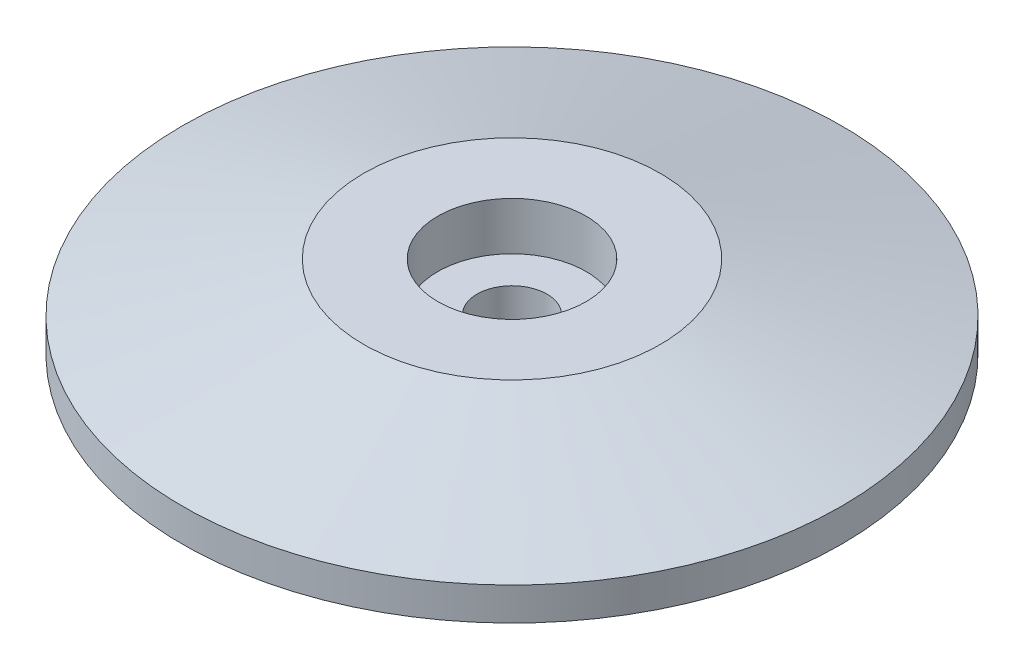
ISO-10303-21;
HEADER;
FILE_DESCRIPTION(('STEP AP214'),'2;1');
FILE_NAME('part.step','',(''),(''),'','','');
FILE_SCHEMA(('AUTOMOTIVE_DESIGN { 1 0 10303 214 1 1 1 1 }'));
ENDSEC;
DATA;
#1=APPLICATION_CONTEXT('core data for automotive mechanical design processes');
#2=APPLICATION_PROTOCOL_DEFINITION('international standard','automotive_design',2000,#1);
#3=PRODUCT_CONTEXT('',#1,'mechanical');
#4=PRODUCT('Part','Part','',(#3));
#5=PRODUCT_RELATED_PRODUCT_CATEGORY('part','',(#4));
#6=PRODUCT_DEFINITION_FORMATION('','',#4);
#7=PRODUCT_DEFINITION_CONTEXT('part definition',#1,'design');
#8=PRODUCT_DEFINITION('design','',#6,#7);
#9=PRODUCT_DEFINITION_SHAPE('','',#8);
#10=(LENGTH_UNIT() NAMED_UNIT(*) SI_UNIT(.MILLI.,.METRE.));
#11=(NAMED_UNIT(*) PLANE_ANGLE_UNIT() SI_UNIT($,.RADIAN.));
#12=(NAMED_UNIT(*) SI_UNIT($,.STERADIAN.) SOLID_ANGLE_UNIT());
#13=UNCERTAINTY_MEASURE_WITH_UNIT(LENGTH_MEASURE(1.E-05),#10,'distance_accuracy_value','');
#14=(GEOMETRIC_REPRESENTATION_CONTEXT(3) GLOBAL_UNCERTAINTY_ASSIGNED_CONTEXT((#13)) GLOBAL_UNIT_ASSIGNED_CONTEXT((#10,
#11,#12)) REPRESENTATION_CONTEXT('',''));
#15=CARTESIAN_POINT('',(0.,0.,0.));
#16=DIRECTION('',(0.,0.,1.));
#17=DIRECTION('',(1.,0.,0.));
#18=AXIS2_PLACEMENT_3D('',#15,#16,#17);
#19=CARTESIAN_POINT('',(28.575,15.875,0.));
#20=DIRECTION('',(0.,-1.,0.));
#21=DIRECTION('',(1.,0.,0.));
#22=AXIS2_PLACEMENT_3D('',#19,#20,#21);
#23=PLANE('',#22);
#24=CARTESIAN_POINT('',(0.,15.875,0.));
#25=DIRECTION('',(0.,1.,0.));
#26=DIRECTION('',(0.,0.,1.));
#27=AXIS2_PLACEMENT_3D('',#24,#25,#26);
#28=CIRCLE('',#27,14.2875);
#29=CARTESIAN_POINT('',(0.,15.875,14.2875));
#30=VERTEX_POINT('',#29);
#31=EDGE_CURVE('E80',#30,#30,#28,.T.);
#32=ORIENTED_EDGE('',*,*,#31,.F.);
#33=EDGE_LOOP('',(#32));
#34=FACE_BOUND('',#33,.T.);
#35=CARTESIAN_POINT('',(0.,15.875,0.));
#36=DIRECTION('',(0.,1.,0.));
#37=DIRECTION('',(-1.,0.,0.));
#38=AXIS2_PLACEMENT_3D('',#35,#36,#37);
#39=CIRCLE('',#38,28.575);
#40=CARTESIAN_POINT('',(-28.575,15.875,0.));
#41=VERTEX_POINT('',#40);
#42=EDGE_CURVE('E10',#41,#41,#39,.T.);
#43=ORIENTED_EDGE('',*,*,#42,.T.);
#44=EDGE_LOOP('',(#43));
#45=FACE_BOUND('',#44,.T.);
#46=ADVANCED_FACE('F37',(#34,#45),#23,.F.);
#47=CARTESIAN_POINT('',(0.,6.35000000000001,0.));
#48=DIRECTION('',(0.,-1.,0.));
#49=DIRECTION('',(1.,0.,0.));
#50=AXIS2_PLACEMENT_3D('',#47,#48,#49);
#51=CONICAL_SURFACE('',#50,63.5,1.30454427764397);
#52=ORIENTED_EDGE('',*,*,#42,.F.);
#53=EDGE_LOOP('',(#52));
#54=FACE_BOUND('',#53,.T.);
#55=CARTESIAN_POINT('',(0.,6.35000000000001,0.));
#56=DIRECTION('',(0.,1.,0.));
#57=DIRECTION('',(-1.,0.,0.));
#58=AXIS2_PLACEMENT_3D('',#55,#56,#57);
#59=CIRCLE('',#58,63.5);
#60=CARTESIAN_POINT('',(-63.5,6.35000000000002,0.));
#61=VERTEX_POINT('',#60);
#62=EDGE_CURVE('E50',#61,#61,#59,.T.);
#63=ORIENTED_EDGE('',*,*,#62,.T.);
#64=EDGE_LOOP('',(#63));
#65=FACE_BOUND('',#64,.T.);
#66=ADVANCED_FACE('F120',(#54,#65),#51,.T.);
#67=CARTESIAN_POINT('',(0.,15.875,0.));
#68=DIRECTION('',(0.,1.,0.));
#69=DIRECTION('',(-1.,0.,0.));
#70=AXIS2_PLACEMENT_3D('',#67,#68,#69);
#71=CYLINDRICAL_SURFACE('',#70,63.5);
#72=ORIENTED_EDGE('',*,*,#62,.F.);
#73=EDGE_LOOP('',(#72));
#74=FACE_BOUND('',#73,.T.);
#75=CARTESIAN_POINT('',(0.,0.,0.));
#76=DIRECTION('',(0.,1.,0.));
#77=DIRECTION('',(-1.,0.,0.));
#78=AXIS2_PLACEMENT_3D('',#75,#76,#77);
#79=CIRCLE('',#78,63.5);
#80=CARTESIAN_POINT('',(-63.5,0.,0.));
#81=VERTEX_POINT('',#80);
#82=EDGE_CURVE('E52',#81,#81,#79,.T.);
#83=ORIENTED_EDGE('',*,*,#82,.T.);
#84=EDGE_LOOP('',(#83));
#85=FACE_BOUND('',#84,.T.);
#86=ADVANCED_FACE('F122',(#74,#85),#71,.T.);
#87=CARTESIAN_POINT('',(0.,0.,0.));
#88=DIRECTION('',(0.,1.,0.));
#89=DIRECTION('',(-1.,0.,0.));
#90=AXIS2_PLACEMENT_3D('',#87,#88,#89);
#91=PLANE('',#90);
#92=CARTESIAN_POINT('',(0.,0.,0.));
#93=DIRECTION('',(0.,-1.,0.));
#94=DIRECTION('',(0.,0.,-1.));
#95=AXIS2_PLACEMENT_3D('',#92,#93,#94);
#96=CIRCLE('',#95,31.75);
#97=CARTESIAN_POINT('',(0.,0.,-31.75));
#98=VERTEX_POINT('',#97);
#99=EDGE_CURVE('E66',#98,#98,#96,.T.);
#100=ORIENTED_EDGE('',*,*,#99,.F.);
#101=EDGE_LOOP('',(#100));
#102=FACE_BOUND('',#101,.T.);
#103=ORIENTED_EDGE('',*,*,#82,.F.);
#104=EDGE_LOOP('',(#103));
#105=FACE_BOUND('',#104,.T.);
#106=ADVANCED_FACE('F127',(#102,#105),#91,.F.);
#107=CARTESIAN_POINT('',(0.,0.,0.));
#108=DIRECTION('',(0.,-1.,0.));
#109=DIRECTION('',(0.,0.,-1.));
#110=AXIS2_PLACEMENT_3D('',#107,#108,#109);
#111=CYLINDRICAL_SURFACE('',#110,26.9875);
#112=CARTESIAN_POINT('',(0.,0.,0.));
#113=DIRECTION('',(0.,-1.,0.));
#114=DIRECTION('',(0.,0.,-1.));
#115=AXIS2_PLACEMENT_3D('',#112,#113,#114);
#116=CIRCLE('',#115,26.9875);
#117=CARTESIAN_POINT('',(0.,0.,-26.9875));
#118=VERTEX_POINT('',#117);
#119=EDGE_CURVE('E73',#118,#118,#116,.T.);
#120=ORIENTED_EDGE('',*,*,#119,.F.);
#121=EDGE_LOOP('',(#120));
#122=FACE_BOUND('',#121,.T.);
#123=CARTESIAN_POINT('',(0.,3.17500000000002,0.));
#124=DIRECTION('',(0.,-1.,0.));
#125=DIRECTION('',(0.,0.,-1.));
#126=AXIS2_PLACEMENT_3D('',#123,#124,#125);
#127=CIRCLE('',#126,26.9875);
#128=CARTESIAN_POINT('',(0.,3.17500000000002,-26.9875));
#129=VERTEX_POINT('',#128);
#130=EDGE_CURVE('E56',#129,#129,#127,.T.);
#131=ORIENTED_EDGE('',*,*,#130,.T.);
#132=EDGE_LOOP('',(#131));
#133=FACE_BOUND('',#132,.T.);
#134=ADVANCED_FACE('F135',(#122,#133),#111,.T.);
#135=CARTESIAN_POINT('',(26.9875,3.17500000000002,0.));
#136=DIRECTION('',(0.,1.,0.));
#137=DIRECTION('',(0.,0.,1.));
#138=AXIS2_PLACEMENT_3D('',#135,#136,#137);
#139=PLANE('',#138);
#140=ORIENTED_EDGE('',*,*,#130,.F.);
#141=EDGE_LOOP('',(#140));
#142=FACE_BOUND('',#141,.T.);
#143=CARTESIAN_POINT('',(0.,3.17500000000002,0.));
#144=DIRECTION('',(0.,-1.,0.));
#145=DIRECTION('',(0.,0.,-1.));
#146=AXIS2_PLACEMENT_3D('',#143,#144,#145);
#147=CIRCLE('',#146,31.75);
#148=CARTESIAN_POINT('',(0.,3.17500000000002,-31.75));
#149=VERTEX_POINT('',#148);
#150=EDGE_CURVE('E63',#149,#149,#147,.T.);
#151=ORIENTED_EDGE('',*,*,#150,.T.);
#152=EDGE_LOOP('',(#151));
#153=FACE_BOUND('',#152,.T.);
#154=ADVANCED_FACE('F137',(#142,#153),#139,.F.);
#155=CARTESIAN_POINT('',(0.,0.,0.));
#156=DIRECTION('',(0.,-1.,0.));
#157=DIRECTION('',(0.,0.,-1.));
#158=AXIS2_PLACEMENT_3D('',#155,#156,#157);
#159=CYLINDRICAL_SURFACE('',#158,31.75);
#160=ORIENTED_EDGE('',*,*,#150,.F.);
#161=EDGE_LOOP('',(#160));
#162=FACE_BOUND('',#161,.T.);
#163=ORIENTED_EDGE('',*,*,#99,.T.);
#164=EDGE_LOOP('',(#163));
#165=FACE_BOUND('',#164,.T.);
#166=ADVANCED_FACE('F138',(#162,#165),#159,.F.);
#167=CARTESIAN_POINT('',(0.,0.,0.));
#168=DIRECTION('',(0.,1.,0.));
#169=DIRECTION('',(0.,0.,1.));
#170=AXIS2_PLACEMENT_3D('',#167,#168,#169);
#171=CIRCLE('',#170,6.74624);
#172=CARTESIAN_POINT('',(0.,0.,6.74624));
#173=VERTEX_POINT('',#172);
#174=EDGE_CURVE('E87',#173,#173,#171,.T.);
#175=ORIENTED_EDGE('',*,*,#174,.T.);
#176=EDGE_LOOP('',(#175));
#177=FACE_BOUND('',#176,.T.);
#178=ORIENTED_EDGE('',*,*,#119,.T.);
#179=EDGE_LOOP('',(#178));
#180=FACE_BOUND('',#179,.T.);
#181=ADVANCED_FACE('F94',(#177,#180),#91,.F.);
#182=CARTESIAN_POINT('',(0.,15.875,0.));
#183=DIRECTION('',(0.,1.,0.));
#184=DIRECTION('',(0.,0.,1.));
#185=AXIS2_PLACEMENT_3D('',#182,#183,#184);
#186=CYLINDRICAL_SURFACE('',#185,14.2875);
#187=CARTESIAN_POINT('',(0.,6.6294,0.));
#188=DIRECTION('',(0.,1.,0.));
#189=DIRECTION('',(0.,0.,1.));
#190=AXIS2_PLACEMENT_3D('',#187,#188,#189);
#191=CIRCLE('',#190,14.2875);
#192=CARTESIAN_POINT('',(0.,6.6294,14.2875));
#193=VERTEX_POINT('',#192);
#194=EDGE_CURVE('E83',#193,#193,#191,.T.);
#195=ORIENTED_EDGE('',*,*,#194,.F.);
#196=EDGE_LOOP('',(#195));
#197=FACE_BOUND('',#196,.T.);
#198=ORIENTED_EDGE('',*,*,#31,.T.);
#199=EDGE_LOOP('',(#198));
#200=FACE_BOUND('',#199,.T.);
#201=ADVANCED_FACE('F110',(#197,#200),#186,.F.);
#202=CARTESIAN_POINT('',(6.74624,6.6294,0.));
#203=DIRECTION('',(0.,-1.,0.));
#204=DIRECTION('',(0.,0.,-1.));
#205=AXIS2_PLACEMENT_3D('',#202,#203,#204);
#206=PLANE('',#205);
#207=CARTESIAN_POINT('',(0.,6.6294,0.));
#208=DIRECTION('',(0.,1.,0.));
#209=DIRECTION('',(0.,0.,1.));
#210=AXIS2_PLACEMENT_3D('',#207,#208,#209);
#211=CIRCLE('',#210,6.74624);
#212=CARTESIAN_POINT('',(0.,6.6294,6.74624));
#213=VERTEX_POINT('',#212);
#214=EDGE_CURVE('E84',#213,#213,#211,.T.);
#215=ORIENTED_EDGE('',*,*,#214,.F.);
#216=EDGE_LOOP('',(#215));
#217=FACE_BOUND('',#216,.T.);
#218=ORIENTED_EDGE('',*,*,#194,.T.);
#219=EDGE_LOOP('',(#218));
#220=FACE_BOUND('',#219,.T.);
#221=ADVANCED_FACE('F101',(#217,#220),#206,.F.);
#222=CARTESIAN_POINT('',(0.,15.875,0.));
#223=DIRECTION('',(0.,1.,0.));
#224=DIRECTION('',(0.,0.,1.));
#225=AXIS2_PLACEMENT_3D('',#222,#223,#224);
#226=CYLINDRICAL_SURFACE('',#225,6.74624);
#227=ORIENTED_EDGE('',*,*,#174,.F.);
#228=EDGE_LOOP('',(#227));
#229=FACE_BOUND('',#228,.T.);
#230=ORIENTED_EDGE('',*,*,#214,.T.);
#231=EDGE_LOOP('',(#230));
#232=FACE_BOUND('',#231,.T.);
#233=ADVANCED_FACE('F96',(#229,#232),#226,.F.);
#234=CLOSED_SHELL('',(#46,#66,#86,#106,#134,#154,#166,#181,#201,#221,#233));
#235=MANIFOLD_SOLID_BREP('B2',#234);
#236=ADVANCED_BREP_SHAPE_REPRESENTATION('',(#18,#235),#14);
#237=SHAPE_DEFINITION_REPRESENTATION(#9,#236);
ENDSEC;
END-ISO-10303-21;
